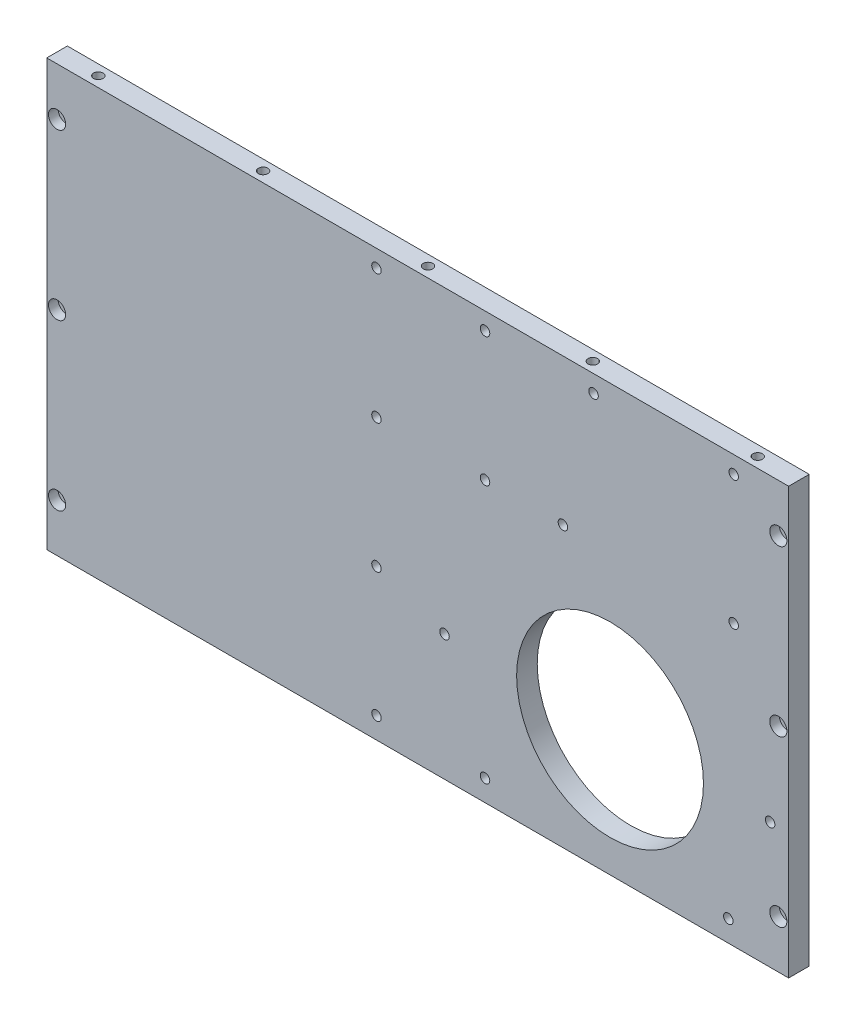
from build123d import *

# Parameters (mm, degrees)
SKETCH1_W                                           = 342.9
SKETCH1_H                                           = 196.85
BOSS_EXTRUDE1_DEPTH                                 = 9.525
CBORE_FOR_8_BINDING_HEAD_MACHINE_SCREW1_D           = 4.3053
CBORE_FOR_8_BINDING_HEAD_MACHINE_SCREW1_CBORE_D     = 7.9375
CBORE_FOR_8_BINDING_HEAD_MACHINE_SCREW1_CBORE_DEPTH = 4.4196
SKETCH5_R                                           = 2.1971
CUT_EXTRUDE1_DEPTH                                  = 15.24
CUT_EXTRUDE2_START                                  = -15.24
SKETCH6_R                                           = 2.1971
CUT_EXTRUDE2_DEPTH                                  = 15.24
SKETCH7_R                                           = 43.18
CUT_EXTRUDE3_DEPTH                                  = 198.922481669
SKETCH8_R                                           = 2.1971
CUT_EXTRUDE4_DEPTH                                  = 198.922481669


with BuildPart() as part:
    # Sketch1 → Boss-Extrude1 (new body)
    with BuildSketch(Plane.XY):
        Rectangle(SKETCH1_W, SKETCH1_H)
    extrude(amount=BOSS_EXTRUDE1_DEPTH)

    # CBORE for _8 Binding Head Machine Screw1 (through all)
    with Locations(Plane.XY.offset(9.525)):
        with Locations((-166.6875, 76.2), (-166.6875, 0), (-166.6875, -76.2), (166.6875, 76.2), (166.6875, 0), (166.6875, -76.2)):
            CounterBoreHole(CBORE_FOR_8_BINDING_HEAD_MACHINE_SCREW1_D / 2, CBORE_FOR_8_BINDING_HEAD_MACHINE_SCREW1_CBORE_D / 2, CBORE_FOR_8_BINDING_HEAD_MACHINE_SCREW1_CBORE_DEPTH)

    # Sketch5 → Cut-Extrude1 (cut)
    with BuildSketch(Plane(origin=(0, 98.425, 0), x_dir=(1, 0, 0), z_dir=(0, 1, 0))):
        with Locations(Location((0, -4.7625, 0), (0, 0, 270))):
            Circle(SKETCH5_R)
        with Locations(Location((76.2, -4.7625, 0), (0, 0, 270))):
            Circle(SKETCH5_R)
        with Locations(Location((152.4, -4.7625, 0), (0, 0, 270))):
            Circle(SKETCH5_R)
        with Locations(Location((-76.2, -4.7625, 0), (0, 0, 270))):
            Circle(SKETCH5_R)
        with Locations(Location((-152.4, -4.7625, 0), (0, 0, 270))):
            Circle(SKETCH5_R)
    extrude(amount=-CUT_EXTRUDE1_DEPTH, mode=Mode.SUBTRACT)

    # Sketch6 → Cut-Extrude2 (cut)
    with BuildSketch(Plane.XZ.offset(98.425).offset(CUT_EXTRUDE2_START)):
        with Locations(Location((0, 4.7625, 0), (0, 0, 90))):
            Circle(SKETCH6_R)
        with Locations(Location((76.2, 4.7625, 0), (0, 0, 90))):
            Circle(SKETCH6_R)
        with Locations(Location((152.4, 4.7625, 0), (0, 0, 90))):
            Circle(SKETCH6_R)
        with Locations(Location((-76.2, 4.7625, 0), (0, 0, 90))):
            Circle(SKETCH6_R)
        with Locations(Location((-152.4, 4.7625, 0), (0, 0, 90))):
            Circle(SKETCH6_R)
    extrude(amount=CUT_EXTRUDE2_DEPTH, mode=Mode.SUBTRACT)

    # Sketch7 → Cut-Extrude3 (cut, through all)
    with BuildSketch(Plane.XY.offset(9.525)):
        with Locations((88.9, -40.2844)):
            Circle(SKETCH7_R)
    extrude(amount=-CUT_EXTRUDE3_DEPTH, mode=Mode.SUBTRACT)

    # Sketch8 → Cut-Extrude4 (cut, through all)
    with BuildSketch(Plane.XY.offset(9.525)):
        with Locations((-19.05, 90.4875)):
            Circle(SKETCH8_R)
        with Locations((31.115, 90.4875)):
            Circle(SKETCH8_R)
        with Locations((81.28, 90.4875)):
            Circle(SKETCH8_R)
        with Locations((146.05, 90.4875)):
            Circle(SKETCH8_R)
        with Locations((67.121179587, 30.7975)):
            Circle(SKETCH8_R)
        with Locations((31.115, 30.7975)):
            Circle(SKETCH8_R)
        with Locations((-19.05, 30.7975)):
            Circle(SKETCH8_R)
        with Locations((-19.05, -28.8925)):
            Circle(SKETCH8_R)
        with Locations((12.38981688, -40.2844)):
            Circle(SKETCH8_R)
        with Locations((-19.05, -88.5825)):
            Circle(SKETCH8_R)
        with Locations((31.115, -88.5825)):
            Circle(SKETCH8_R)
        with Locations((146.05, 30.7975)):
            Circle(SKETCH8_R)
        with Locations((162.901064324, -40.2844)):
            Circle(SKETCH8_R)
        with Locations((143.566615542, -88.5825)):
            Circle(SKETCH8_R)
    extrude(amount=-CUT_EXTRUDE4_DEPTH, mode=Mode.SUBTRACT)


solid = part.part
